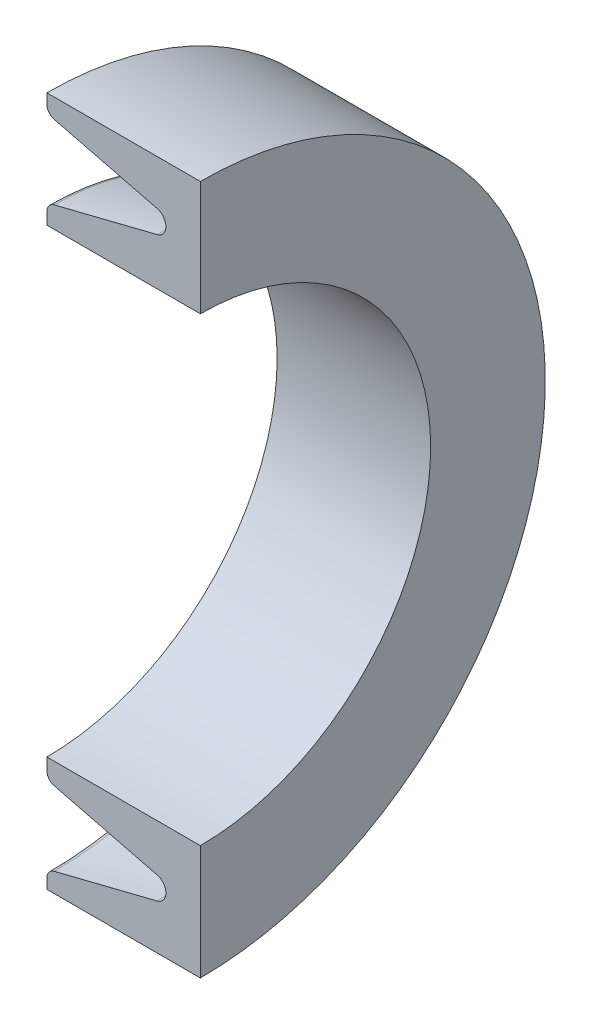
from build123d import *

# Parameters (mm, degrees)
ESQUISSE2_W             = 19
ESQUISSE2_H             = 37
ENL_V_MAT_EXTRU_2_DEPTH = 50


with BuildPart() as part:
    # Esquisse1 → Base-R_volution (revolve)
    with BuildSketch(Plane.XY):
        with BuildLine():
            Line((-20, 40), (-12.1, 40))
            Line((-12.1, 40), (-12.1, 34.1))
            Line((-12.1, 34.1), (-20, 34.1))
            Line((-20, 34.1), (-20, 34.609611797))
            ThreePointArc((-20, 34.609611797), (-19.894102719, 34.917317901), (-19.621267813, 35.094683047))
            Line((-19.621267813, 35.094683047), (-14.328342, 36.4179145))
            ThreePointArc((-14.328342, 36.4179145), (-13.873863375, 37), (-14.328342, 37.5820855))
            Line((-14.328342, 37.5820855), (-19.621267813, 38.905316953))
            ThreePointArc((-19.621267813, 38.905316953), (-19.894102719, 39.082682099), (-20, 39.390388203))
            Line((-20, 39.390388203), (-20, 40))
        make_face()
    revolve(axis=Axis((-28.1, 51.85, 0), (1, 0, 0)))

    # Esquisse2 → Enl_v. mat.-Extru.2 (cut)
    with BuildSketch(Plane(origin=(-12.1, 0, 0), x_dir=(0, 0, -1), z_dir=(1, 0, 0))):
        with Locations((-9.5, 51.5)):
            Rectangle(ESQUISSE2_W, ESQUISSE2_H)
    extrude(amount=-ENL_V_MAT_EXTRU_2_DEPTH, mode=Mode.SUBTRACT)


solid = part.part
